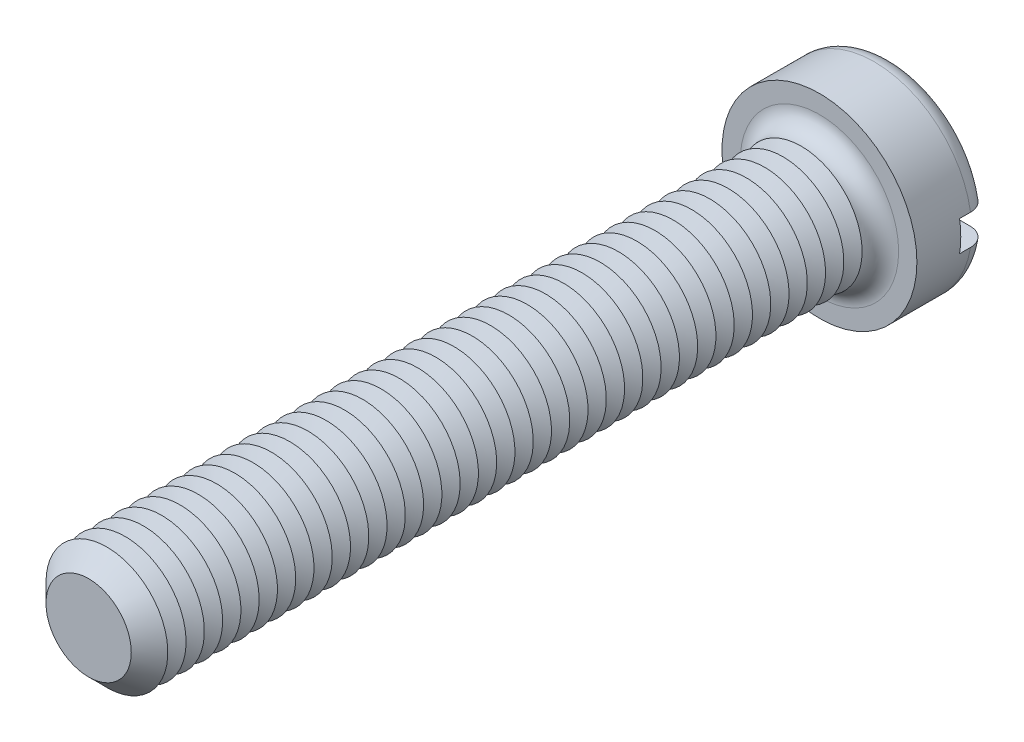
from build123d import *

# Parameters (mm, degrees)
SKETCH3_R           = 8
BOSS_EXTRUDE2_DEPTH = 6
SKETCH4_R           = 5
BOSS_EXTRUDE3_DEPTH = 60
FILLET1_R           = 1.5
CHAMFER1_SIZE       = 1.5
LPATTERN1_COUNT     = 38
LPATTERN1_PITCH     = 1.5
SKETCH8_W           = 16
SKETCH8_H           = 2.5
CUT_EXTRUDE1_DEPTH  = 2.4


with BuildPart() as part:
    # Sketch3 → Boss-Extrude2 (new body)
    with BuildSketch(Plane.XY):
        Circle(SKETCH3_R)
    extrude(amount=-BOSS_EXTRUDE2_DEPTH)

    # Sketch4 → Boss-Extrude3 (add)
    with BuildSketch(Plane.XY):
        Circle(SKETCH4_R)
    extrude(amount=BOSS_EXTRUDE3_DEPTH)

    # Fillet1
    fillet1_edges = [part.edges().sort_by_distance(p)[0] for p in [
        (-8, 0, -6),
        (-5, 0, 0),
    ]]
    fillet(fillet1_edges, radius=FILLET1_R)

    # Chamfer1
    chamfer1_edges = [part.edges().sort_by_distance(p)[0] for p in [
        (-5, 0, 60),
    ]]
    chamfer(chamfer1_edges, length=CHAMFER1_SIZE)

    # Sketch6 → Cut-Revolve1 (revolve, cut)
    with BuildSketch(Plane(origin=(0, 0, 0), x_dir=(0, 0, -1), z_dir=(1, 0, 0)), mode=Mode.PRIVATE) as cut_revolve1_sk:
        Polygon((-1.5, 5), (-2.25, 3.700961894), (-3, 5), align=None)
    cut_revolve1 = revolve(cut_revolve1_sk.sketch.rotate(Axis((0, 0, -1.694361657), (0, 0, 1)), 90), axis=Axis((0, 0, -1.694361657), (0, 0, 1)), mode=Mode.SUBTRACT)

    # LPattern1: Cut-Revolve1 ×38
    with Locations(*[(0, 0, i * LPATTERN1_PITCH) for i in range(1, LPATTERN1_COUNT)]):
        add(cut_revolve1, mode=Mode.SUBTRACT)

    # Sketch8 → Cut-Extrude1 (cut)
    with BuildSketch(Plane(origin=(0, 0, -6), x_dir=(-1, 0, 0), z_dir=(0, 0, -1))):
        Rectangle(SKETCH8_W, SKETCH8_H)
    extrude(amount=-CUT_EXTRUDE1_DEPTH, mode=Mode.SUBTRACT)


solid = part.part
